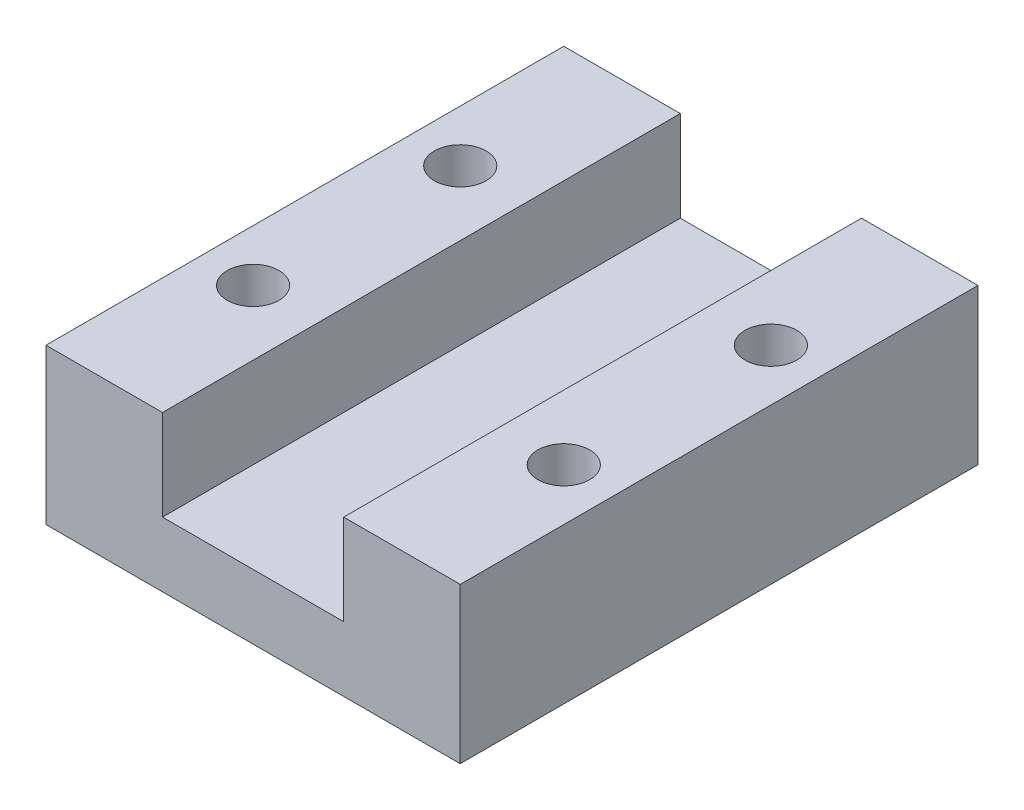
ISO-10303-21;
HEADER;
FILE_DESCRIPTION(('STEP AP214'),'2;1');
FILE_NAME('part.step','',(''),(''),'','','');
FILE_SCHEMA(('AUTOMOTIVE_DESIGN { 1 0 10303 214 1 1 1 1 }'));
ENDSEC;
DATA;
#1=APPLICATION_CONTEXT('core data for automotive mechanical design processes');
#2=APPLICATION_PROTOCOL_DEFINITION('international standard','automotive_design',2000,#1);
#3=PRODUCT_CONTEXT('',#1,'mechanical');
#4=PRODUCT('Part','Part','',(#3));
#5=PRODUCT_RELATED_PRODUCT_CATEGORY('part','',(#4));
#6=PRODUCT_DEFINITION_FORMATION('','',#4);
#7=PRODUCT_DEFINITION_CONTEXT('part definition',#1,'design');
#8=PRODUCT_DEFINITION('design','',#6,#7);
#9=PRODUCT_DEFINITION_SHAPE('','',#8);
#10=(LENGTH_UNIT() NAMED_UNIT(*) SI_UNIT(.MILLI.,.METRE.));
#11=(NAMED_UNIT(*) PLANE_ANGLE_UNIT() SI_UNIT($,.RADIAN.));
#12=(NAMED_UNIT(*) SI_UNIT($,.STERADIAN.) SOLID_ANGLE_UNIT());
#13=UNCERTAINTY_MEASURE_WITH_UNIT(LENGTH_MEASURE(1.E-05),#10,'distance_accuracy_value','');
#14=(GEOMETRIC_REPRESENTATION_CONTEXT(3) GLOBAL_UNCERTAINTY_ASSIGNED_CONTEXT((#13)) GLOBAL_UNIT_ASSIGNED_CONTEXT((#10,
#11,#12)) REPRESENTATION_CONTEXT('',''));
#15=CARTESIAN_POINT('',(0.,0.,0.));
#16=DIRECTION('',(0.,0.,1.));
#17=DIRECTION('',(1.,0.,0.));
#18=AXIS2_PLACEMENT_3D('',#15,#16,#17);
#19=CARTESIAN_POINT('',(0.,6.,0.));
#20=DIRECTION('',(0.,-1.,0.));
#21=DIRECTION('',(0.,0.,-1.));
#22=AXIS2_PLACEMENT_3D('',#19,#20,#21);
#23=PLANE('',#22);
#24=CARTESIAN_POINT('',(6.,6.,4.));
#25=DIRECTION('',(0.,-1.,0.));
#26=DIRECTION('',(0.,0.,-1.));
#27=AXIS2_PLACEMENT_3D('',#24,#25,#26);
#28=CIRCLE('',#27,0.999999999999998);
#29=CARTESIAN_POINT('',(6.,6.,3.));
#30=VERTEX_POINT('',#29);
#31=EDGE_CURVE('E203',#30,#30,#28,.T.);
#32=ORIENTED_EDGE('',*,*,#31,.T.);
#33=EDGE_LOOP('',(#32));
#34=FACE_BOUND('',#33,.T.);
#35=CARTESIAN_POINT('',(6.,6.,-4.));
#36=DIRECTION('',(0.,-1.,0.));
#37=DIRECTION('',(0.,0.,-1.));
#38=AXIS2_PLACEMENT_3D('',#35,#36,#37);
#39=CIRCLE('',#38,0.999999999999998);
#40=CARTESIAN_POINT('',(6.,6.,-5.));
#41=VERTEX_POINT('',#40);
#42=EDGE_CURVE('E184',#41,#41,#39,.T.);
#43=ORIENTED_EDGE('',*,*,#42,.T.);
#44=EDGE_LOOP('',(#43));
#45=FACE_BOUND('',#44,.T.);
#46=DIRECTION('',(-1.,0.,0.));
#47=VECTOR('',#46,1.);
#48=CARTESIAN_POINT('',(-8.,6.,-10.));
#49=LINE('',#48,#47);
#50=CARTESIAN_POINT('',(8.,6.,-10.));
#51=VERTEX_POINT('',#50);
#52=CARTESIAN_POINT('',(3.5,6.,-10.));
#53=VERTEX_POINT('',#52);
#54=EDGE_CURVE('E92',#51,#53,#49,.T.);
#55=ORIENTED_EDGE('',*,*,#54,.T.);
#56=DIRECTION('',(0.,0.,1.));
#57=VECTOR('',#56,1.);
#58=CARTESIAN_POINT('',(3.5,6.,0.));
#59=LINE('',#58,#57);
#60=CARTESIAN_POINT('',(3.5,6.,10.));
#61=VERTEX_POINT('',#60);
#62=EDGE_CURVE('E11',#53,#61,#59,.T.);
#63=ORIENTED_EDGE('',*,*,#62,.T.);
#64=DIRECTION('',(1.,0.,0.));
#65=VECTOR('',#64,1.);
#66=CARTESIAN_POINT('',(-8.,6.,10.));
#67=LINE('',#66,#65);
#68=CARTESIAN_POINT('',(8.,6.,10.));
#69=VERTEX_POINT('',#68);
#70=EDGE_CURVE('E62',#61,#69,#67,.T.);
#71=ORIENTED_EDGE('',*,*,#70,.T.);
#72=DIRECTION('',(0.,0.,-1.));
#73=VECTOR('',#72,1.);
#74=CARTESIAN_POINT('',(8.,6.,10.));
#75=LINE('',#74,#73);
#76=EDGE_CURVE('E143',#69,#51,#75,.T.);
#77=ORIENTED_EDGE('',*,*,#76,.T.);
#78=EDGE_LOOP('',(#55,#63,#71,#77));
#79=FACE_BOUND('',#78,.T.);
#80=ADVANCED_FACE('F39',(#34,#45,#79),#23,.F.);
#81=CARTESIAN_POINT('',(8.,6.,10.));
#82=DIRECTION('',(-1.,0.,0.));
#83=DIRECTION('',(0.,0.,1.));
#84=AXIS2_PLACEMENT_3D('',#81,#82,#83);
#85=PLANE('',#84);
#86=DIRECTION('',(0.,0.,-1.));
#87=VECTOR('',#86,1.);
#88=CARTESIAN_POINT('',(8.,0.,10.));
#89=LINE('',#88,#87);
#90=CARTESIAN_POINT('',(8.,0.,10.));
#91=VERTEX_POINT('',#90);
#92=CARTESIAN_POINT('',(8.,0.,-10.));
#93=VERTEX_POINT('',#92);
#94=EDGE_CURVE('E142',#91,#93,#89,.T.);
#95=ORIENTED_EDGE('',*,*,#94,.T.);
#96=DIRECTION('',(0.,-1.,0.));
#97=VECTOR('',#96,1.);
#98=CARTESIAN_POINT('',(8.,6.,-10.));
#99=LINE('',#98,#97);
#100=EDGE_CURVE('E165',#51,#93,#99,.T.);
#101=ORIENTED_EDGE('',*,*,#100,.F.);
#102=ORIENTED_EDGE('',*,*,#76,.F.);
#103=DIRECTION('',(0.,-1.,0.));
#104=VECTOR('',#103,1.);
#105=CARTESIAN_POINT('',(8.,6.,10.));
#106=LINE('',#105,#104);
#107=EDGE_CURVE('E151',#69,#91,#106,.T.);
#108=ORIENTED_EDGE('',*,*,#107,.T.);
#109=EDGE_LOOP('',(#95,#101,#102,#108));
#110=FACE_BOUND('',#109,.T.);
#111=ADVANCED_FACE('F41',(#110),#85,.F.);
#112=CARTESIAN_POINT('',(-8.,6.,-10.));
#113=DIRECTION('',(0.,0.,1.));
#114=DIRECTION('',(1.,0.,0.));
#115=AXIS2_PLACEMENT_3D('',#112,#113,#114);
#116=PLANE('',#115);
#117=DIRECTION('',(1.,0.,0.));
#118=VECTOR('',#117,1.);
#119=CARTESIAN_POINT('',(-8.,2.5,-10.));
#120=LINE('',#119,#118);
#121=CARTESIAN_POINT('',(-3.5,2.5,-10.));
#122=VERTEX_POINT('',#121);
#123=CARTESIAN_POINT('',(3.5,2.5,-10.));
#124=VERTEX_POINT('',#123);
#125=EDGE_CURVE('E123',#122,#124,#120,.T.);
#126=ORIENTED_EDGE('',*,*,#125,.T.);
#127=DIRECTION('',(0.,1.,0.));
#128=VECTOR('',#127,1.);
#129=CARTESIAN_POINT('',(3.5,6.,-10.));
#130=LINE('',#129,#128);
#131=EDGE_CURVE('E139',#124,#53,#130,.T.);
#132=ORIENTED_EDGE('',*,*,#131,.T.);
#133=ORIENTED_EDGE('',*,*,#54,.F.);
#134=ORIENTED_EDGE('',*,*,#100,.T.);
#135=DIRECTION('',(-1.,0.,0.));
#136=VECTOR('',#135,1.);
#137=CARTESIAN_POINT('',(-8.,0.,-10.));
#138=LINE('',#137,#136);
#139=CARTESIAN_POINT('',(-8.,0.,-10.));
#140=VERTEX_POINT('',#139);
#141=EDGE_CURVE('E154',#93,#140,#138,.T.);
#142=ORIENTED_EDGE('',*,*,#141,.T.);
#143=DIRECTION('',(0.,-1.,0.));
#144=VECTOR('',#143,1.);
#145=CARTESIAN_POINT('',(-8.,6.,-10.));
#146=LINE('',#145,#144);
#147=CARTESIAN_POINT('',(-8.,6.,-10.));
#148=VERTEX_POINT('',#147);
#149=EDGE_CURVE('E162',#148,#140,#146,.T.);
#150=ORIENTED_EDGE('',*,*,#149,.F.);
#151=CARTESIAN_POINT('',(-3.5,6.,-10.));
#152=VERTEX_POINT('',#151);
#153=EDGE_CURVE('E145',#152,#148,#49,.T.);
#154=ORIENTED_EDGE('',*,*,#153,.F.);
#155=DIRECTION('',(0.,-1.,0.));
#156=VECTOR('',#155,1.);
#157=CARTESIAN_POINT('',(-3.5,6.,-10.));
#158=LINE('',#157,#156);
#159=EDGE_CURVE('E54',#152,#122,#158,.T.);
#160=ORIENTED_EDGE('',*,*,#159,.T.);
#161=EDGE_LOOP('',(#126,#132,#133,#134,#142,#150,#154,#160));
#162=FACE_BOUND('',#161,.T.);
#163=ADVANCED_FACE('F170',(#162),#116,.F.);
#164=CARTESIAN_POINT('',(-8.,6.,10.));
#165=DIRECTION('',(1.,0.,0.));
#166=DIRECTION('',(0.,0.,-1.));
#167=AXIS2_PLACEMENT_3D('',#164,#165,#166);
#168=PLANE('',#167);
#169=DIRECTION('',(0.,0.,1.));
#170=VECTOR('',#169,1.);
#171=CARTESIAN_POINT('',(-8.,0.,10.));
#172=LINE('',#171,#170);
#173=CARTESIAN_POINT('',(-8.,0.,10.));
#174=VERTEX_POINT('',#173);
#175=EDGE_CURVE('E156',#140,#174,#172,.T.);
#176=ORIENTED_EDGE('',*,*,#175,.T.);
#177=DIRECTION('',(0.,-1.,0.));
#178=VECTOR('',#177,1.);
#179=CARTESIAN_POINT('',(-8.,6.,10.));
#180=LINE('',#179,#178);
#181=CARTESIAN_POINT('',(-8.,6.,10.));
#182=VERTEX_POINT('',#181);
#183=EDGE_CURVE('E160',#182,#174,#180,.T.);
#184=ORIENTED_EDGE('',*,*,#183,.F.);
#185=DIRECTION('',(0.,0.,1.));
#186=VECTOR('',#185,1.);
#187=CARTESIAN_POINT('',(-8.,6.,10.));
#188=LINE('',#187,#186);
#189=EDGE_CURVE('E147',#148,#182,#188,.T.);
#190=ORIENTED_EDGE('',*,*,#189,.F.);
#191=ORIENTED_EDGE('',*,*,#149,.T.);
#192=EDGE_LOOP('',(#176,#184,#190,#191));
#193=FACE_BOUND('',#192,.T.);
#194=ADVANCED_FACE('F175',(#193),#168,.F.);
#195=CARTESIAN_POINT('',(-8.,6.,10.));
#196=DIRECTION('',(0.,0.,-1.));
#197=DIRECTION('',(-1.,0.,0.));
#198=AXIS2_PLACEMENT_3D('',#195,#196,#197);
#199=PLANE('',#198);
#200=ORIENTED_EDGE('',*,*,#70,.F.);
#201=DIRECTION('',(0.,1.,0.));
#202=VECTOR('',#201,1.);
#203=CARTESIAN_POINT('',(3.5,9.5,10.));
#204=LINE('',#203,#202);
#205=CARTESIAN_POINT('',(3.5,2.5,10.));
#206=VERTEX_POINT('',#205);
#207=EDGE_CURVE('E131',#206,#61,#204,.T.);
#208=ORIENTED_EDGE('',*,*,#207,.F.);
#209=DIRECTION('',(1.,0.,0.));
#210=VECTOR('',#209,1.);
#211=CARTESIAN_POINT('',(-3.5,2.5,10.));
#212=LINE('',#211,#210);
#213=CARTESIAN_POINT('',(-3.5,2.5,10.));
#214=VERTEX_POINT('',#213);
#215=EDGE_CURVE('E120',#214,#206,#212,.T.);
#216=ORIENTED_EDGE('',*,*,#215,.F.);
#217=DIRECTION('',(0.,-1.,0.));
#218=VECTOR('',#217,1.);
#219=CARTESIAN_POINT('',(-3.5,9.50000000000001,10.));
#220=LINE('',#219,#218);
#221=CARTESIAN_POINT('',(-3.5,6.,10.));
#222=VERTEX_POINT('',#221);
#223=EDGE_CURVE('E127',#222,#214,#220,.T.);
#224=ORIENTED_EDGE('',*,*,#223,.F.);
#225=EDGE_CURVE('E149',#182,#222,#67,.T.);
#226=ORIENTED_EDGE('',*,*,#225,.F.);
#227=ORIENTED_EDGE('',*,*,#183,.T.);
#228=DIRECTION('',(1.,0.,0.));
#229=VECTOR('',#228,1.);
#230=CARTESIAN_POINT('',(-8.,0.,10.));
#231=LINE('',#230,#229);
#232=EDGE_CURVE('E84',#174,#91,#231,.T.);
#233=ORIENTED_EDGE('',*,*,#232,.T.);
#234=ORIENTED_EDGE('',*,*,#107,.F.);
#235=EDGE_LOOP('',(#200,#208,#216,#224,#226,#227,#233,#234));
#236=FACE_BOUND('',#235,.T.);
#237=ADVANCED_FACE('F133',(#236),#199,.F.);
#238=CARTESIAN_POINT('',(-6.,6.,-4.));
#239=DIRECTION('',(0.,-1.,0.));
#240=DIRECTION('',(0.,0.,-1.));
#241=AXIS2_PLACEMENT_3D('',#238,#239,#240);
#242=CIRCLE('',#241,0.999999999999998);
#243=CARTESIAN_POINT('',(-6.,6.,-5.));
#244=VERTEX_POINT('',#243);
#245=EDGE_CURVE('E197',#244,#244,#242,.T.);
#246=ORIENTED_EDGE('',*,*,#245,.T.);
#247=EDGE_LOOP('',(#246));
#248=FACE_BOUND('',#247,.T.);
#249=CARTESIAN_POINT('',(-6.,6.,4.));
#250=DIRECTION('',(0.,-1.,0.));
#251=DIRECTION('',(0.,0.,-1.));
#252=AXIS2_PLACEMENT_3D('',#249,#250,#251);
#253=CIRCLE('',#252,0.999999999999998);
#254=CARTESIAN_POINT('',(-6.,6.,3.));
#255=VERTEX_POINT('',#254);
#256=EDGE_CURVE('E191',#255,#255,#253,.T.);
#257=ORIENTED_EDGE('',*,*,#256,.T.);
#258=EDGE_LOOP('',(#257));
#259=FACE_BOUND('',#258,.T.);
#260=ORIENTED_EDGE('',*,*,#225,.T.);
#261=DIRECTION('',(0.,0.,-1.));
#262=VECTOR('',#261,1.);
#263=CARTESIAN_POINT('',(-3.5,6.,0.));
#264=LINE('',#263,#262);
#265=EDGE_CURVE('E47',#222,#152,#264,.T.);
#266=ORIENTED_EDGE('',*,*,#265,.T.);
#267=ORIENTED_EDGE('',*,*,#153,.T.);
#268=ORIENTED_EDGE('',*,*,#189,.T.);
#269=EDGE_LOOP('',(#260,#266,#267,#268));
#270=FACE_BOUND('',#269,.T.);
#271=ADVANCED_FACE('F168',(#248,#259,#270),#23,.F.);
#272=CARTESIAN_POINT('',(0.,0.,0.));
#273=DIRECTION('',(0.,-1.,0.));
#274=DIRECTION('',(0.,0.,-1.));
#275=AXIS2_PLACEMENT_3D('',#272,#273,#274);
#276=PLANE('',#275);
#277=CARTESIAN_POINT('',(6.,0.,4.));
#278=DIRECTION('',(0.,-1.,0.));
#279=DIRECTION('',(0.,0.,-1.));
#280=AXIS2_PLACEMENT_3D('',#277,#278,#279);
#281=CIRCLE('',#280,0.999999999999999);
#282=CARTESIAN_POINT('',(6.,0.,3.));
#283=VERTEX_POINT('',#282);
#284=EDGE_CURVE('E206',#283,#283,#281,.T.);
#285=ORIENTED_EDGE('',*,*,#284,.F.);
#286=EDGE_LOOP('',(#285));
#287=FACE_BOUND('',#286,.T.);
#288=CARTESIAN_POINT('',(-6.,0.,-4.));
#289=DIRECTION('',(0.,-1.,0.));
#290=DIRECTION('',(0.,0.,-1.));
#291=AXIS2_PLACEMENT_3D('',#288,#289,#290);
#292=CIRCLE('',#291,0.999999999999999);
#293=CARTESIAN_POINT('',(-6.,0.,-5.));
#294=VERTEX_POINT('',#293);
#295=EDGE_CURVE('E200',#294,#294,#292,.T.);
#296=ORIENTED_EDGE('',*,*,#295,.F.);
#297=EDGE_LOOP('',(#296));
#298=FACE_BOUND('',#297,.T.);
#299=CARTESIAN_POINT('',(-6.,0.,4.));
#300=DIRECTION('',(0.,-1.,0.));
#301=DIRECTION('',(0.,0.,-1.));
#302=AXIS2_PLACEMENT_3D('',#299,#300,#301);
#303=CIRCLE('',#302,0.999999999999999);
#304=CARTESIAN_POINT('',(-6.,0.,3.));
#305=VERTEX_POINT('',#304);
#306=EDGE_CURVE('E194',#305,#305,#303,.T.);
#307=ORIENTED_EDGE('',*,*,#306,.F.);
#308=EDGE_LOOP('',(#307));
#309=FACE_BOUND('',#308,.T.);
#310=CARTESIAN_POINT('',(6.,0.,-4.));
#311=DIRECTION('',(0.,-1.,0.));
#312=DIRECTION('',(0.,0.,-1.));
#313=AXIS2_PLACEMENT_3D('',#310,#311,#312);
#314=CIRCLE('',#313,0.999999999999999);
#315=CARTESIAN_POINT('',(6.,0.,-5.));
#316=VERTEX_POINT('',#315);
#317=EDGE_CURVE('E186',#316,#316,#314,.T.);
#318=ORIENTED_EDGE('',*,*,#317,.F.);
#319=EDGE_LOOP('',(#318));
#320=FACE_BOUND('',#319,.T.);
#321=ORIENTED_EDGE('',*,*,#94,.F.);
#322=ORIENTED_EDGE('',*,*,#232,.F.);
#323=ORIENTED_EDGE('',*,*,#175,.F.);
#324=ORIENTED_EDGE('',*,*,#141,.F.);
#325=EDGE_LOOP('',(#321,#322,#323,#324));
#326=FACE_BOUND('',#325,.T.);
#327=ADVANCED_FACE('F178',(#287,#298,#309,#320,#326),#276,.T.);
#328=CARTESIAN_POINT('',(-3.5,2.5,-30.));
#329=DIRECTION('',(0.,-1.,0.));
#330=DIRECTION('',(0.,0.,-1.));
#331=AXIS2_PLACEMENT_3D('',#328,#329,#330);
#332=PLANE('',#331);
#333=DIRECTION('',(0.,0.,1.));
#334=VECTOR('',#333,1.);
#335=CARTESIAN_POINT('',(-3.5,2.5,-30.));
#336=LINE('',#335,#334);
#337=EDGE_CURVE('E115',#122,#214,#336,.T.);
#338=ORIENTED_EDGE('',*,*,#337,.T.);
#339=ORIENTED_EDGE('',*,*,#215,.T.);
#340=DIRECTION('',(0.,0.,1.));
#341=VECTOR('',#340,1.);
#342=CARTESIAN_POINT('',(3.5,2.5,-30.));
#343=LINE('',#342,#341);
#344=EDGE_CURVE('E124',#124,#206,#343,.T.);
#345=ORIENTED_EDGE('',*,*,#344,.F.);
#346=ORIENTED_EDGE('',*,*,#125,.F.);
#347=EDGE_LOOP('',(#338,#339,#345,#346));
#348=FACE_BOUND('',#347,.T.);
#349=ADVANCED_FACE('F117',(#348),#332,.F.);
#350=CARTESIAN_POINT('',(3.5,9.5,-30.));
#351=DIRECTION('',(1.,0.,0.));
#352=DIRECTION('',(0.,1.,0.));
#353=AXIS2_PLACEMENT_3D('',#350,#351,#352);
#354=PLANE('',#353);
#355=ORIENTED_EDGE('',*,*,#344,.T.);
#356=ORIENTED_EDGE('',*,*,#207,.T.);
#357=ORIENTED_EDGE('',*,*,#62,.F.);
#358=ORIENTED_EDGE('',*,*,#131,.F.);
#359=EDGE_LOOP('',(#355,#356,#357,#358));
#360=FACE_BOUND('',#359,.T.);
#361=ADVANCED_FACE('F183',(#360),#354,.F.);
#362=CARTESIAN_POINT('',(-3.5,9.50000000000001,-30.));
#363=DIRECTION('',(-1.,0.,0.));
#364=DIRECTION('',(0.,-1.,0.));
#365=AXIS2_PLACEMENT_3D('',#362,#363,#364);
#366=PLANE('',#365);
#367=ORIENTED_EDGE('',*,*,#265,.F.);
#368=ORIENTED_EDGE('',*,*,#223,.T.);
#369=ORIENTED_EDGE('',*,*,#337,.F.);
#370=ORIENTED_EDGE('',*,*,#159,.F.);
#371=EDGE_LOOP('',(#367,#368,#369,#370));
#372=FACE_BOUND('',#371,.T.);
#373=ADVANCED_FACE('F128',(#372),#366,.F.);
#374=CARTESIAN_POINT('',(6.,0.,-4.));
#375=DIRECTION('',(0.,-1.,0.));
#376=DIRECTION('',(0.,0.,-1.));
#377=AXIS2_PLACEMENT_3D('',#374,#375,#376);
#378=CYLINDRICAL_SURFACE('',#377,0.999999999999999);
#379=ORIENTED_EDGE('',*,*,#42,.F.);
#380=EDGE_LOOP('',(#379));
#381=FACE_BOUND('',#380,.T.);
#382=ORIENTED_EDGE('',*,*,#317,.T.);
#383=EDGE_LOOP('',(#382));
#384=FACE_BOUND('',#383,.T.);
#385=ADVANCED_FACE('F221',(#381,#384),#378,.F.);
#386=CARTESIAN_POINT('',(-6.,0.,4.));
#387=DIRECTION('',(0.,-1.,0.));
#388=DIRECTION('',(0.,0.,-1.));
#389=AXIS2_PLACEMENT_3D('',#386,#387,#388);
#390=CYLINDRICAL_SURFACE('',#389,0.999999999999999);
#391=ORIENTED_EDGE('',*,*,#256,.F.);
#392=EDGE_LOOP('',(#391));
#393=FACE_BOUND('',#392,.T.);
#394=ORIENTED_EDGE('',*,*,#306,.T.);
#395=EDGE_LOOP('',(#394));
#396=FACE_BOUND('',#395,.T.);
#397=ADVANCED_FACE('F223',(#393,#396),#390,.F.);
#398=CARTESIAN_POINT('',(-6.,0.,-4.));
#399=DIRECTION('',(0.,-1.,0.));
#400=DIRECTION('',(0.,0.,-1.));
#401=AXIS2_PLACEMENT_3D('',#398,#399,#400);
#402=CYLINDRICAL_SURFACE('',#401,0.999999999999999);
#403=ORIENTED_EDGE('',*,*,#245,.F.);
#404=EDGE_LOOP('',(#403));
#405=FACE_BOUND('',#404,.T.);
#406=ORIENTED_EDGE('',*,*,#295,.T.);
#407=EDGE_LOOP('',(#406));
#408=FACE_BOUND('',#407,.T.);
#409=ADVANCED_FACE('F230',(#405,#408),#402,.F.);
#410=CARTESIAN_POINT('',(6.,0.,4.));
#411=DIRECTION('',(0.,-1.,0.));
#412=DIRECTION('',(0.,0.,-1.));
#413=AXIS2_PLACEMENT_3D('',#410,#411,#412);
#414=CYLINDRICAL_SURFACE('',#413,0.999999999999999);
#415=ORIENTED_EDGE('',*,*,#31,.F.);
#416=EDGE_LOOP('',(#415));
#417=FACE_BOUND('',#416,.T.);
#418=ORIENTED_EDGE('',*,*,#284,.T.);
#419=EDGE_LOOP('',(#418));
#420=FACE_BOUND('',#419,.T.);
#421=ADVANCED_FACE('F210',(#417,#420),#414,.F.);
#422=CLOSED_SHELL('',(#80,#111,#163,#194,#237,#271,#327,#349,#361,#373,#385,#397,#409,#421));
#423=MANIFOLD_SOLID_BREP('B2',#422);
#424=ADVANCED_BREP_SHAPE_REPRESENTATION('',(#18,#423),#14);
#425=SHAPE_DEFINITION_REPRESENTATION(#9,#424);
ENDSEC;
END-ISO-10303-21;
